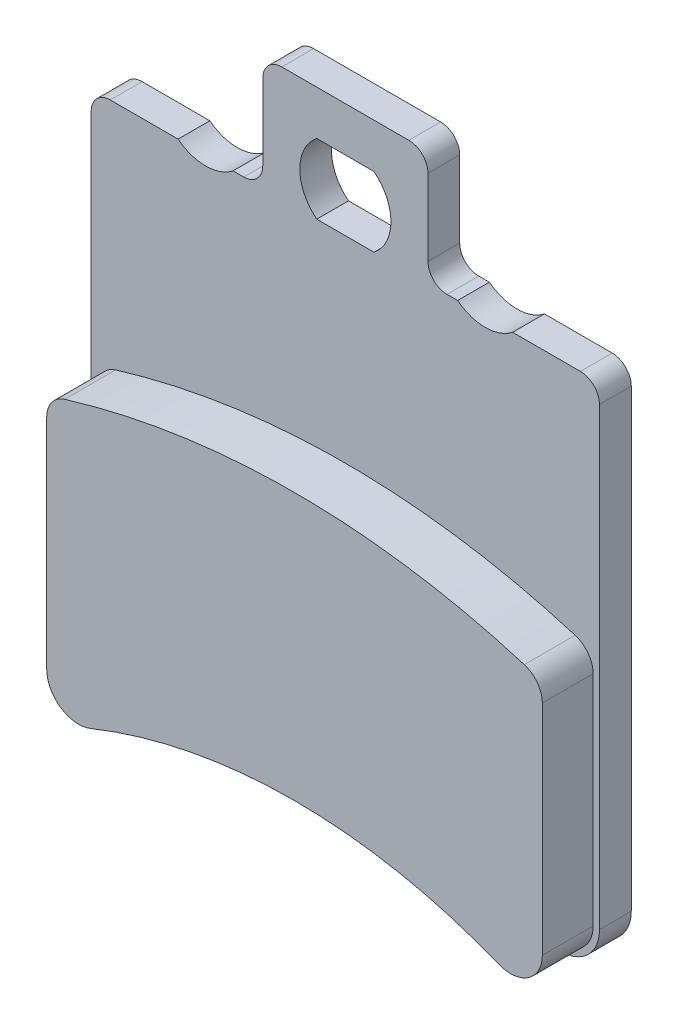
ISO-10303-21;
HEADER;
FILE_DESCRIPTION(('STEP AP214'),'2;1');
FILE_NAME('part.step','',(''),(''),'','','');
FILE_SCHEMA(('AUTOMOTIVE_DESIGN { 1 0 10303 214 1 1 1 1 }'));
ENDSEC;
DATA;
#1=APPLICATION_CONTEXT('core data for automotive mechanical design processes');
#2=APPLICATION_PROTOCOL_DEFINITION('international standard','automotive_design',2000,#1);
#3=PRODUCT_CONTEXT('',#1,'mechanical');
#4=PRODUCT('Part','Part','',(#3));
#5=PRODUCT_RELATED_PRODUCT_CATEGORY('part','',(#4));
#6=PRODUCT_DEFINITION_FORMATION('','',#4);
#7=PRODUCT_DEFINITION_CONTEXT('part definition',#1,'design');
#8=PRODUCT_DEFINITION('design','',#6,#7);
#9=PRODUCT_DEFINITION_SHAPE('','',#8);
#10=(LENGTH_UNIT() NAMED_UNIT(*) SI_UNIT(.MILLI.,.METRE.));
#11=(NAMED_UNIT(*) PLANE_ANGLE_UNIT() SI_UNIT($,.RADIAN.));
#12=(NAMED_UNIT(*) SI_UNIT($,.STERADIAN.) SOLID_ANGLE_UNIT());
#13=UNCERTAINTY_MEASURE_WITH_UNIT(LENGTH_MEASURE(1.E-05),#10,'distance_accuracy_value','');
#14=(GEOMETRIC_REPRESENTATION_CONTEXT(3) GLOBAL_UNCERTAINTY_ASSIGNED_CONTEXT((#13)) GLOBAL_UNIT_ASSIGNED_CONTEXT((#10,
#11,#12)) REPRESENTATION_CONTEXT('',''));
#15=CARTESIAN_POINT('',(0.,0.,0.));
#16=DIRECTION('',(0.,0.,1.));
#17=DIRECTION('',(1.,0.,0.));
#18=AXIS2_PLACEMENT_3D('',#15,#16,#17);
#19=CARTESIAN_POINT('',(-17.,-17.2951424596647,2.5));
#20=DIRECTION('',(0.,0.,1.));
#21=DIRECTION('',(1.,0.,0.));
#22=AXIS2_PLACEMENT_3D('',#19,#20,#21);
#23=PLANE('',#22);
#24=CARTESIAN_POINT('',(-17.5,-0.104115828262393,2.5));
#25=DIRECTION('',(0.,0.,1.));
#26=DIRECTION('',(-1.,0.,0.));
#27=AXIS2_PLACEMENT_3D('',#24,#25,#26);
#28=CIRCLE('',#27,2.);
#29=CARTESIAN_POINT('',(-18.0823316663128,1.80922936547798,2.5));
#30=VERTEX_POINT('',#29);
#31=CARTESIAN_POINT('',(-19.5,-0.104115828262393,2.5));
#32=VERTEX_POINT('',#31);
#33=EDGE_CURVE('E41',#30,#32,#28,.T.);
#34=ORIENTED_EDGE('',*,*,#33,.F.);
#35=CARTESIAN_POINT('',(0.,-57.6032058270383,2.5));
#36=DIRECTION('',(0.,0.,1.));
#37=DIRECTION('',(-1.,0.,0.));
#38=AXIS2_PLACEMENT_3D('',#35,#36,#37);
#39=CIRCLE('',#38,62.1032058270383);
#40=CARTESIAN_POINT('',(18.0823316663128,1.80922936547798,2.5));
#41=VERTEX_POINT('',#40);
#42=EDGE_CURVE('E45',#41,#30,#39,.T.);
#43=ORIENTED_EDGE('',*,*,#42,.F.);
#44=CARTESIAN_POINT('',(17.5,-0.104115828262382,2.5));
#45=DIRECTION('',(0.,0.,1.));
#46=DIRECTION('',(1.,0.,0.));
#47=AXIS2_PLACEMENT_3D('',#44,#45,#46);
#48=CIRCLE('',#47,2.);
#49=CARTESIAN_POINT('',(19.5,-0.104115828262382,2.5));
#50=VERTEX_POINT('',#49);
#51=EDGE_CURVE('E741',#50,#41,#48,.T.);
#52=ORIENTED_EDGE('',*,*,#51,.F.);
#53=DIRECTION('',(0.,1.,0.));
#54=VECTOR('',#53,1.);
#55=CARTESIAN_POINT('',(19.5,-17.2951424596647,2.5));
#56=LINE('',#55,#54);
#57=CARTESIAN_POINT('',(19.5,-17.2951424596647,2.5));
#58=VERTEX_POINT('',#57);
#59=EDGE_CURVE('E738',#58,#50,#56,.T.);
#60=ORIENTED_EDGE('',*,*,#59,.F.);
#61=CARTESIAN_POINT('',(17.,-17.2951424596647,2.5));
#62=DIRECTION('',(0.,0.,1.));
#63=DIRECTION('',(1.,0.,0.));
#64=AXIS2_PLACEMENT_3D('',#61,#62,#63);
#65=CIRCLE('',#64,2.5);
#66=CARTESIAN_POINT('',(16.0659340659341,-19.6140906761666,2.5));
#67=VERTEX_POINT('',#66);
#68=EDGE_CURVE('E735',#67,#58,#65,.T.);
#69=ORIENTED_EDGE('',*,*,#68,.F.);
#70=CARTESIAN_POINT('',(0.,-59.5,2.5));
#71=DIRECTION('',(0.,0.,-1.));
#72=DIRECTION('',(1.,0.,0.));
#73=AXIS2_PLACEMENT_3D('',#70,#71,#72);
#74=CIRCLE('',#73,43.);
#75=CARTESIAN_POINT('',(-16.0659340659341,-19.6140906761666,2.5));
#76=VERTEX_POINT('',#75);
#77=EDGE_CURVE('E237',#76,#67,#74,.T.);
#78=ORIENTED_EDGE('',*,*,#77,.F.);
#79=CARTESIAN_POINT('',(-17.,-17.2951424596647,2.5));
#80=DIRECTION('',(0.,0.,1.));
#81=DIRECTION('',(1.,0.,0.));
#82=AXIS2_PLACEMENT_3D('',#79,#80,#81);
#83=CIRCLE('',#82,2.5);
#84=CARTESIAN_POINT('',(-19.5,-17.2951424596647,2.5));
#85=VERTEX_POINT('',#84);
#86=EDGE_CURVE('E231',#85,#76,#83,.T.);
#87=ORIENTED_EDGE('',*,*,#86,.F.);
#88=DIRECTION('',(0.,-1.,0.));
#89=VECTOR('',#88,1.);
#90=CARTESIAN_POINT('',(-19.5,-0.104115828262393,2.5));
#91=LINE('',#90,#89);
#92=EDGE_CURVE('E234',#32,#85,#91,.T.);
#93=ORIENTED_EDGE('',*,*,#92,.F.);
#94=EDGE_LOOP('',(#34,#43,#52,#60,#69,#78,#87,#93));
#95=FACE_BOUND('',#94,.T.);
#96=CARTESIAN_POINT('',(-17.,-17.2951424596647,2.5));
#97=DIRECTION('',(0.,0.,1.));
#98=DIRECTION('',(1.,0.,0.));
#99=AXIS2_PLACEMENT_3D('',#96,#97,#98);
#100=CIRCLE('',#99,3.);
#101=CARTESIAN_POINT('',(-20.,-17.2951424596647,2.5));
#102=VERTEX_POINT('',#101);
#103=CARTESIAN_POINT('',(-15.8791208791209,-20.077880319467,2.5));
#104=VERTEX_POINT('',#103);
#105=EDGE_CURVE('E332',#102,#104,#100,.T.);
#106=ORIENTED_EDGE('',*,*,#105,.T.);
#107=CARTESIAN_POINT('',(0.,-59.5,2.5));
#108=DIRECTION('',(0.,0.,-1.));
#109=DIRECTION('',(-1.,0.,0.));
#110=AXIS2_PLACEMENT_3D('',#107,#108,#109);
#111=CIRCLE('',#110,42.5);
#112=CARTESIAN_POINT('',(15.8791208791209,-20.077880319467,2.5));
#113=VERTEX_POINT('',#112);
#114=EDGE_CURVE('E335',#104,#113,#111,.T.);
#115=ORIENTED_EDGE('',*,*,#114,.T.);
#116=CARTESIAN_POINT('',(17.,-17.2951424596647,2.5));
#117=DIRECTION('',(0.,0.,1.));
#118=DIRECTION('',(-1.,0.,0.));
#119=AXIS2_PLACEMENT_3D('',#116,#117,#118);
#120=CIRCLE('',#119,3.);
#121=CARTESIAN_POINT('',(20.,-17.2951424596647,2.5));
#122=VERTEX_POINT('',#121);
#123=EDGE_CURVE('E337',#113,#122,#120,.T.);
#124=ORIENTED_EDGE('',*,*,#123,.T.);
#125=DIRECTION('',(0.,1.,0.));
#126=VECTOR('',#125,1.);
#127=CARTESIAN_POINT('',(20.,-17.2951424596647,2.5));
#128=LINE('',#127,#126);
#129=CARTESIAN_POINT('',(20.,18.5,2.5));
#130=VERTEX_POINT('',#129);
#131=EDGE_CURVE('E339',#122,#130,#128,.T.);
#132=ORIENTED_EDGE('',*,*,#131,.T.);
#133=CARTESIAN_POINT('',(18.5,18.5,2.5));
#134=DIRECTION('',(0.,0.,1.));
#135=DIRECTION('',(1.,0.,0.));
#136=AXIS2_PLACEMENT_3D('',#133,#134,#135);
#137=CIRCLE('',#136,1.5);
#138=CARTESIAN_POINT('',(18.5,20.,2.5));
#139=VERTEX_POINT('',#138);
#140=EDGE_CURVE('E341',#130,#139,#137,.T.);
#141=ORIENTED_EDGE('',*,*,#140,.T.);
#142=DIRECTION('',(-1.,0.,0.));
#143=VECTOR('',#142,1.);
#144=CARTESIAN_POINT('',(13.1650635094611,20.,2.5));
#145=LINE('',#144,#143);
#146=CARTESIAN_POINT('',(13.1650635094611,20.,2.5));
#147=VERTEX_POINT('',#146);
#148=EDGE_CURVE('E343',#139,#147,#145,.T.);
#149=ORIENTED_EDGE('',*,*,#148,.T.);
#150=CARTESIAN_POINT('',(11.,22.75,2.5));
#151=DIRECTION('',(0.,0.,-1.));
#152=DIRECTION('',(1.,0.,0.));
#153=AXIS2_PLACEMENT_3D('',#150,#151,#152);
#154=CIRCLE('',#153,3.5);
#155=CARTESIAN_POINT('',(8.8349364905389,20.,2.5));
#156=VERTEX_POINT('',#155);
#157=EDGE_CURVE('E345',#147,#156,#154,.T.);
#158=ORIENTED_EDGE('',*,*,#157,.T.);
#159=DIRECTION('',(-1.,0.,0.));
#160=VECTOR('',#159,1.);
#161=CARTESIAN_POINT('',(8.,20.,2.5));
#162=LINE('',#161,#160);
#163=CARTESIAN_POINT('',(8.,20.,2.5));
#164=VERTEX_POINT('',#163);
#165=EDGE_CURVE('E347',#156,#164,#162,.T.);
#166=ORIENTED_EDGE('',*,*,#165,.T.);
#167=CARTESIAN_POINT('',(8.,21.5,2.5));
#168=DIRECTION('',(0.,0.,-1.));
#169=DIRECTION('',(1.,0.,0.));
#170=AXIS2_PLACEMENT_3D('',#167,#168,#169);
#171=CIRCLE('',#170,1.5);
#172=CARTESIAN_POINT('',(6.5,21.5,2.5));
#173=VERTEX_POINT('',#172);
#174=EDGE_CURVE('E349',#164,#173,#171,.T.);
#175=ORIENTED_EDGE('',*,*,#174,.T.);
#176=DIRECTION('',(0.,1.,0.));
#177=VECTOR('',#176,1.);
#178=CARTESIAN_POINT('',(6.5,21.5,2.5));
#179=LINE('',#178,#177);
#180=CARTESIAN_POINT('',(6.5,27.5,2.5));
#181=VERTEX_POINT('',#180);
#182=EDGE_CURVE('E351',#173,#181,#179,.T.);
#183=ORIENTED_EDGE('',*,*,#182,.T.);
#184=CARTESIAN_POINT('',(5.,27.5,2.5));
#185=DIRECTION('',(0.,0.,1.));
#186=DIRECTION('',(1.,0.,0.));
#187=AXIS2_PLACEMENT_3D('',#184,#185,#186);
#188=CIRCLE('',#187,1.5);
#189=CARTESIAN_POINT('',(5.,29.,2.5));
#190=VERTEX_POINT('',#189);
#191=EDGE_CURVE('E353',#181,#190,#188,.T.);
#192=ORIENTED_EDGE('',*,*,#191,.T.);
#193=DIRECTION('',(-1.,0.,0.));
#194=VECTOR('',#193,1.);
#195=CARTESIAN_POINT('',(-5.,29.,2.5));
#196=LINE('',#195,#194);
#197=CARTESIAN_POINT('',(-5.,29.,2.5));
#198=VERTEX_POINT('',#197);
#199=EDGE_CURVE('E355',#190,#198,#196,.T.);
#200=ORIENTED_EDGE('',*,*,#199,.T.);
#201=CARTESIAN_POINT('',(-5.,27.5,2.5));
#202=DIRECTION('',(0.,0.,1.));
#203=DIRECTION('',(1.,0.,0.));
#204=AXIS2_PLACEMENT_3D('',#201,#202,#203);
#205=CIRCLE('',#204,1.5);
#206=CARTESIAN_POINT('',(-6.5,27.5,2.5));
#207=VERTEX_POINT('',#206);
#208=EDGE_CURVE('E357',#198,#207,#205,.T.);
#209=ORIENTED_EDGE('',*,*,#208,.T.);
#210=DIRECTION('',(0.,-1.,0.));
#211=VECTOR('',#210,1.);
#212=CARTESIAN_POINT('',(-6.5,21.5,2.5));
#213=LINE('',#212,#211);
#214=CARTESIAN_POINT('',(-6.5,21.5,2.5));
#215=VERTEX_POINT('',#214);
#216=EDGE_CURVE('E359',#207,#215,#213,.T.);
#217=ORIENTED_EDGE('',*,*,#216,.T.);
#218=CARTESIAN_POINT('',(-8.,21.5,2.5));
#219=DIRECTION('',(0.,0.,-1.));
#220=DIRECTION('',(-1.,0.,0.));
#221=AXIS2_PLACEMENT_3D('',#218,#219,#220);
#222=CIRCLE('',#221,1.5);
#223=CARTESIAN_POINT('',(-8.,20.,2.5));
#224=VERTEX_POINT('',#223);
#225=EDGE_CURVE('E361',#215,#224,#222,.T.);
#226=ORIENTED_EDGE('',*,*,#225,.T.);
#227=DIRECTION('',(-1.,0.,0.));
#228=VECTOR('',#227,1.);
#229=CARTESIAN_POINT('',(-8.8349364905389,20.,2.5));
#230=LINE('',#229,#228);
#231=CARTESIAN_POINT('',(-8.8349364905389,20.,2.5));
#232=VERTEX_POINT('',#231);
#233=EDGE_CURVE('E363',#224,#232,#230,.T.);
#234=ORIENTED_EDGE('',*,*,#233,.T.);
#235=CARTESIAN_POINT('',(-11.,22.75,2.5));
#236=DIRECTION('',(0.,0.,-1.));
#237=DIRECTION('',(-1.,0.,0.));
#238=AXIS2_PLACEMENT_3D('',#235,#236,#237);
#239=CIRCLE('',#238,3.5);
#240=CARTESIAN_POINT('',(-13.1650635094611,20.,2.5));
#241=VERTEX_POINT('',#240);
#242=EDGE_CURVE('E365',#232,#241,#239,.T.);
#243=ORIENTED_EDGE('',*,*,#242,.T.);
#244=DIRECTION('',(-1.,0.,0.));
#245=VECTOR('',#244,1.);
#246=CARTESIAN_POINT('',(-18.5,20.,2.5));
#247=LINE('',#246,#245);
#248=CARTESIAN_POINT('',(-18.5,20.,2.5));
#249=VERTEX_POINT('',#248);
#250=EDGE_CURVE('E367',#241,#249,#247,.T.);
#251=ORIENTED_EDGE('',*,*,#250,.T.);
#252=CARTESIAN_POINT('',(-18.5,18.5,2.5));
#253=DIRECTION('',(0.,0.,1.));
#254=DIRECTION('',(1.,0.,0.));
#255=AXIS2_PLACEMENT_3D('',#252,#253,#254);
#256=CIRCLE('',#255,1.5);
#257=CARTESIAN_POINT('',(-20.,18.5,2.5));
#258=VERTEX_POINT('',#257);
#259=EDGE_CURVE('E369',#249,#258,#256,.T.);
#260=ORIENTED_EDGE('',*,*,#259,.T.);
#261=DIRECTION('',(0.,-1.,0.));
#262=VECTOR('',#261,1.);
#263=CARTESIAN_POINT('',(-20.,-17.2951424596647,2.5));
#264=LINE('',#263,#262);
#265=EDGE_CURVE('E371',#258,#102,#264,.T.);
#266=ORIENTED_EDGE('',*,*,#265,.T.);
#267=EDGE_LOOP('',(#106,#115,#124,#132,#141,#149,#158,#166,#175,#183,#192,#200,#209,#217,#226,
#234,#243,#251,#260,#266));
#268=FACE_BOUND('',#267,.T.);
#269=DIRECTION('',(1.,0.,0.));
#270=VECTOR('',#269,1.);
#271=CARTESIAN_POINT('',(-2.25,20.,2.5));
#272=LINE('',#271,#270);
#273=CARTESIAN_POINT('',(-2.25,20.,2.5));
#274=VERTEX_POINT('',#273);
#275=CARTESIAN_POINT('',(2.25,20.,2.5));
#276=VERTEX_POINT('',#275);
#277=EDGE_CURVE('E274',#274,#276,#272,.T.);
#278=ORIENTED_EDGE('',*,*,#277,.F.);
#279=CARTESIAN_POINT('',(-0.0849364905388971,22.75,2.5));
#280=DIRECTION('',(0.,0.,1.));
#281=DIRECTION('',(1.,0.,0.));
#282=AXIS2_PLACEMENT_3D('',#279,#280,#281);
#283=CIRCLE('',#282,3.5);
#284=CARTESIAN_POINT('',(-2.25,25.5,2.5));
#285=VERTEX_POINT('',#284);
#286=EDGE_CURVE('E272',#285,#274,#283,.T.);
#287=ORIENTED_EDGE('',*,*,#286,.F.);
#288=DIRECTION('',(-1.,0.,0.));
#289=VECTOR('',#288,1.);
#290=CARTESIAN_POINT('',(-2.25,25.5,2.5));
#291=LINE('',#290,#289);
#292=CARTESIAN_POINT('',(2.25,25.5,2.5));
#293=VERTEX_POINT('',#292);
#294=EDGE_CURVE('E279',#293,#285,#291,.T.);
#295=ORIENTED_EDGE('',*,*,#294,.F.);
#296=CARTESIAN_POINT('',(0.0849364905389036,22.75,2.5));
#297=DIRECTION('',(0.,0.,1.));
#298=DIRECTION('',(-1.,0.,0.));
#299=AXIS2_PLACEMENT_3D('',#296,#297,#298);
#300=CIRCLE('',#299,3.5);
#301=EDGE_CURVE('E276',#276,#293,#300,.T.);
#302=ORIENTED_EDGE('',*,*,#301,.F.);
#303=EDGE_LOOP('',(#278,#287,#295,#302));
#304=FACE_BOUND('',#303,.T.);
#305=ADVANCED_FACE('F26',(#95,#268,#304),#23,.T.);
#306=CARTESIAN_POINT('',(-17.,-17.2951424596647,0.));
#307=DIRECTION('',(0.,0.,1.));
#308=DIRECTION('',(1.,0.,0.));
#309=AXIS2_PLACEMENT_3D('',#306,#307,#308);
#310=PLANE('',#309);
#311=CARTESIAN_POINT('',(-17.,-17.2951424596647,0.));
#312=DIRECTION('',(0.,0.,1.));
#313=DIRECTION('',(1.,0.,0.));
#314=AXIS2_PLACEMENT_3D('',#311,#312,#313);
#315=CIRCLE('',#314,3.);
#316=CARTESIAN_POINT('',(-20.,-17.2951424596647,0.));
#317=VERTEX_POINT('',#316);
#318=CARTESIAN_POINT('',(-15.8791208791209,-20.077880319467,0.));
#319=VERTEX_POINT('',#318);
#320=EDGE_CURVE('E291',#317,#319,#315,.T.);
#321=ORIENTED_EDGE('',*,*,#320,.F.);
#322=DIRECTION('',(0.,-1.,0.));
#323=VECTOR('',#322,1.);
#324=CARTESIAN_POINT('',(-20.,-17.2951424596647,0.));
#325=LINE('',#324,#323);
#326=CARTESIAN_POINT('',(-20.,18.5,0.));
#327=VERTEX_POINT('',#326);
#328=EDGE_CURVE('E330',#327,#317,#325,.T.);
#329=ORIENTED_EDGE('',*,*,#328,.F.);
#330=CARTESIAN_POINT('',(-18.5,18.5,0.));
#331=DIRECTION('',(0.,0.,1.));
#332=DIRECTION('',(1.,0.,0.));
#333=AXIS2_PLACEMENT_3D('',#330,#331,#332);
#334=CIRCLE('',#333,1.5);
#335=CARTESIAN_POINT('',(-18.5,20.,0.));
#336=VERTEX_POINT('',#335);
#337=EDGE_CURVE('E328',#336,#327,#334,.T.);
#338=ORIENTED_EDGE('',*,*,#337,.F.);
#339=DIRECTION('',(-1.,0.,0.));
#340=VECTOR('',#339,1.);
#341=CARTESIAN_POINT('',(-18.5,20.,0.));
#342=LINE('',#341,#340);
#343=CARTESIAN_POINT('',(-13.1650635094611,20.,0.));
#344=VERTEX_POINT('',#343);
#345=EDGE_CURVE('E326',#344,#336,#342,.T.);
#346=ORIENTED_EDGE('',*,*,#345,.F.);
#347=CARTESIAN_POINT('',(-11.,22.75,0.));
#348=DIRECTION('',(0.,0.,-1.));
#349=DIRECTION('',(-1.,0.,0.));
#350=AXIS2_PLACEMENT_3D('',#347,#348,#349);
#351=CIRCLE('',#350,3.5);
#352=CARTESIAN_POINT('',(-8.8349364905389,20.,0.));
#353=VERTEX_POINT('',#352);
#354=EDGE_CURVE('E324',#353,#344,#351,.T.);
#355=ORIENTED_EDGE('',*,*,#354,.F.);
#356=DIRECTION('',(-1.,0.,0.));
#357=VECTOR('',#356,1.);
#358=CARTESIAN_POINT('',(-8.8349364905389,20.,0.));
#359=LINE('',#358,#357);
#360=CARTESIAN_POINT('',(-8.,20.,0.));
#361=VERTEX_POINT('',#360);
#362=EDGE_CURVE('E322',#361,#353,#359,.T.);
#363=ORIENTED_EDGE('',*,*,#362,.F.);
#364=CARTESIAN_POINT('',(-8.,21.5,0.));
#365=DIRECTION('',(0.,0.,-1.));
#366=DIRECTION('',(-1.,0.,0.));
#367=AXIS2_PLACEMENT_3D('',#364,#365,#366);
#368=CIRCLE('',#367,1.5);
#369=CARTESIAN_POINT('',(-6.5,21.5,0.));
#370=VERTEX_POINT('',#369);
#371=EDGE_CURVE('E320',#370,#361,#368,.T.);
#372=ORIENTED_EDGE('',*,*,#371,.F.);
#373=DIRECTION('',(0.,-1.,0.));
#374=VECTOR('',#373,1.);
#375=CARTESIAN_POINT('',(-6.5,21.5,0.));
#376=LINE('',#375,#374);
#377=CARTESIAN_POINT('',(-6.5,27.5,0.));
#378=VERTEX_POINT('',#377);
#379=EDGE_CURVE('E318',#378,#370,#376,.T.);
#380=ORIENTED_EDGE('',*,*,#379,.F.);
#381=CARTESIAN_POINT('',(-5.,27.5,0.));
#382=DIRECTION('',(0.,0.,1.));
#383=DIRECTION('',(1.,0.,0.));
#384=AXIS2_PLACEMENT_3D('',#381,#382,#383);
#385=CIRCLE('',#384,1.5);
#386=CARTESIAN_POINT('',(-5.,29.,0.));
#387=VERTEX_POINT('',#386);
#388=EDGE_CURVE('E316',#387,#378,#385,.T.);
#389=ORIENTED_EDGE('',*,*,#388,.F.);
#390=DIRECTION('',(-1.,0.,0.));
#391=VECTOR('',#390,1.);
#392=CARTESIAN_POINT('',(-5.,29.,0.));
#393=LINE('',#392,#391);
#394=CARTESIAN_POINT('',(5.,29.,0.));
#395=VERTEX_POINT('',#394);
#396=EDGE_CURVE('E314',#395,#387,#393,.T.);
#397=ORIENTED_EDGE('',*,*,#396,.F.);
#398=CARTESIAN_POINT('',(5.,27.5,0.));
#399=DIRECTION('',(0.,0.,1.));
#400=DIRECTION('',(1.,0.,0.));
#401=AXIS2_PLACEMENT_3D('',#398,#399,#400);
#402=CIRCLE('',#401,1.5);
#403=CARTESIAN_POINT('',(6.5,27.5,0.));
#404=VERTEX_POINT('',#403);
#405=EDGE_CURVE('E312',#404,#395,#402,.T.);
#406=ORIENTED_EDGE('',*,*,#405,.F.);
#407=DIRECTION('',(0.,1.,0.));
#408=VECTOR('',#407,1.);
#409=CARTESIAN_POINT('',(6.5,21.5,0.));
#410=LINE('',#409,#408);
#411=CARTESIAN_POINT('',(6.5,21.5,0.));
#412=VERTEX_POINT('',#411);
#413=EDGE_CURVE('E310',#412,#404,#410,.T.);
#414=ORIENTED_EDGE('',*,*,#413,.F.);
#415=CARTESIAN_POINT('',(8.,21.5,0.));
#416=DIRECTION('',(0.,0.,-1.));
#417=DIRECTION('',(1.,0.,0.));
#418=AXIS2_PLACEMENT_3D('',#415,#416,#417);
#419=CIRCLE('',#418,1.5);
#420=CARTESIAN_POINT('',(8.,20.,0.));
#421=VERTEX_POINT('',#420);
#422=EDGE_CURVE('E308',#421,#412,#419,.T.);
#423=ORIENTED_EDGE('',*,*,#422,.F.);
#424=DIRECTION('',(-1.,0.,0.));
#425=VECTOR('',#424,1.);
#426=CARTESIAN_POINT('',(8.,20.,0.));
#427=LINE('',#426,#425);
#428=CARTESIAN_POINT('',(8.8349364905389,20.,0.));
#429=VERTEX_POINT('',#428);
#430=EDGE_CURVE('E306',#429,#421,#427,.T.);
#431=ORIENTED_EDGE('',*,*,#430,.F.);
#432=CARTESIAN_POINT('',(11.,22.75,0.));
#433=DIRECTION('',(0.,0.,-1.));
#434=DIRECTION('',(1.,0.,0.));
#435=AXIS2_PLACEMENT_3D('',#432,#433,#434);
#436=CIRCLE('',#435,3.5);
#437=CARTESIAN_POINT('',(13.1650635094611,20.,0.));
#438=VERTEX_POINT('',#437);
#439=EDGE_CURVE('E304',#438,#429,#436,.T.);
#440=ORIENTED_EDGE('',*,*,#439,.F.);
#441=DIRECTION('',(-1.,0.,0.));
#442=VECTOR('',#441,1.);
#443=CARTESIAN_POINT('',(13.1650635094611,20.,0.));
#444=LINE('',#443,#442);
#445=CARTESIAN_POINT('',(18.5,20.,0.));
#446=VERTEX_POINT('',#445);
#447=EDGE_CURVE('E302',#446,#438,#444,.T.);
#448=ORIENTED_EDGE('',*,*,#447,.F.);
#449=CARTESIAN_POINT('',(18.5,18.5,0.));
#450=DIRECTION('',(0.,0.,1.));
#451=DIRECTION('',(1.,0.,0.));
#452=AXIS2_PLACEMENT_3D('',#449,#450,#451);
#453=CIRCLE('',#452,1.5);
#454=CARTESIAN_POINT('',(20.,18.5,0.));
#455=VERTEX_POINT('',#454);
#456=EDGE_CURVE('E300',#455,#446,#453,.T.);
#457=ORIENTED_EDGE('',*,*,#456,.F.);
#458=DIRECTION('',(0.,1.,0.));
#459=VECTOR('',#458,1.);
#460=CARTESIAN_POINT('',(20.,-17.2951424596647,0.));
#461=LINE('',#460,#459);
#462=CARTESIAN_POINT('',(20.,-17.2951424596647,0.));
#463=VERTEX_POINT('',#462);
#464=EDGE_CURVE('E298',#463,#455,#461,.T.);
#465=ORIENTED_EDGE('',*,*,#464,.F.);
#466=CARTESIAN_POINT('',(17.,-17.2951424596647,0.));
#467=DIRECTION('',(0.,0.,1.));
#468=DIRECTION('',(-1.,0.,0.));
#469=AXIS2_PLACEMENT_3D('',#466,#467,#468);
#470=CIRCLE('',#469,3.);
#471=CARTESIAN_POINT('',(15.8791208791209,-20.077880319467,0.));
#472=VERTEX_POINT('',#471);
#473=EDGE_CURVE('E296',#472,#463,#470,.T.);
#474=ORIENTED_EDGE('',*,*,#473,.F.);
#475=CARTESIAN_POINT('',(0.,-59.5,0.));
#476=DIRECTION('',(0.,0.,-1.));
#477=DIRECTION('',(-1.,0.,0.));
#478=AXIS2_PLACEMENT_3D('',#475,#476,#477);
#479=CIRCLE('',#478,42.5);
#480=EDGE_CURVE('E294',#319,#472,#479,.T.);
#481=ORIENTED_EDGE('',*,*,#480,.F.);
#482=EDGE_LOOP('',(#321,#329,#338,#346,#355,#363,#372,#380,#389,#397,#406,#414,#423,#431,#440,
#448,#457,#465,#474,#481));
#483=FACE_BOUND('',#482,.T.);
#484=CARTESIAN_POINT('',(-0.0849364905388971,22.75,0.));
#485=DIRECTION('',(0.,0.,1.));
#486=DIRECTION('',(1.,0.,0.));
#487=AXIS2_PLACEMENT_3D('',#484,#485,#486);
#488=CIRCLE('',#487,3.5);
#489=CARTESIAN_POINT('',(-2.25,25.5,0.));
#490=VERTEX_POINT('',#489);
#491=CARTESIAN_POINT('',(-2.25,20.,0.));
#492=VERTEX_POINT('',#491);
#493=EDGE_CURVE('E255',#490,#492,#488,.T.);
#494=ORIENTED_EDGE('',*,*,#493,.T.);
#495=DIRECTION('',(1.,0.,0.));
#496=VECTOR('',#495,1.);
#497=CARTESIAN_POINT('',(-2.25,20.,0.));
#498=LINE('',#497,#496);
#499=CARTESIAN_POINT('',(2.25,20.,0.));
#500=VERTEX_POINT('',#499);
#501=EDGE_CURVE('E263',#492,#500,#498,.T.);
#502=ORIENTED_EDGE('',*,*,#501,.T.);
#503=CARTESIAN_POINT('',(0.0849364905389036,22.75,0.));
#504=DIRECTION('',(0.,0.,1.));
#505=DIRECTION('',(-1.,0.,0.));
#506=AXIS2_PLACEMENT_3D('',#503,#504,#505);
#507=CIRCLE('',#506,3.5);
#508=CARTESIAN_POINT('',(2.25,25.5,0.));
#509=VERTEX_POINT('',#508);
#510=EDGE_CURVE('E266',#500,#509,#507,.T.);
#511=ORIENTED_EDGE('',*,*,#510,.T.);
#512=DIRECTION('',(-1.,0.,0.));
#513=VECTOR('',#512,1.);
#514=CARTESIAN_POINT('',(-2.25,25.5,0.));
#515=LINE('',#514,#513);
#516=EDGE_CURVE('E269',#509,#490,#515,.T.);
#517=ORIENTED_EDGE('',*,*,#516,.T.);
#518=EDGE_LOOP('',(#494,#502,#511,#517));
#519=FACE_BOUND('',#518,.T.);
#520=ADVANCED_FACE('F437',(#483,#519),#310,.F.);
#521=CARTESIAN_POINT('',(-17.,-17.2951424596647,2.5));
#522=DIRECTION('',(0.,0.,-1.));
#523=DIRECTION('',(-1.,0.,0.));
#524=AXIS2_PLACEMENT_3D('',#521,#522,#523);
#525=CYLINDRICAL_SURFACE('',#524,3.);
#526=ORIENTED_EDGE('',*,*,#320,.T.);
#527=DIRECTION('',(0.,0.,-1.));
#528=VECTOR('',#527,1.);
#529=CARTESIAN_POINT('',(-15.8791208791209,-20.077880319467,2.5));
#530=LINE('',#529,#528);
#531=EDGE_CURVE('E11',#104,#319,#530,.T.);
#532=ORIENTED_EDGE('',*,*,#531,.F.);
#533=ORIENTED_EDGE('',*,*,#105,.F.);
#534=DIRECTION('',(0.,0.,-1.));
#535=VECTOR('',#534,1.);
#536=CARTESIAN_POINT('',(-20.,-17.2951424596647,2.5));
#537=LINE('',#536,#535);
#538=EDGE_CURVE('E373',#102,#317,#537,.T.);
#539=ORIENTED_EDGE('',*,*,#538,.T.);
#540=EDGE_LOOP('',(#526,#532,#533,#539));
#541=FACE_BOUND('',#540,.T.);
#542=ADVANCED_FACE('F28',(#541),#525,.T.);
#543=CARTESIAN_POINT('',(0.,-59.5,2.5));
#544=DIRECTION('',(0.,0.,-1.));
#545=DIRECTION('',(-1.,0.,0.));
#546=AXIS2_PLACEMENT_3D('',#543,#544,#545);
#547=CYLINDRICAL_SURFACE('',#546,42.5);
#548=ORIENTED_EDGE('',*,*,#480,.T.);
#549=DIRECTION('',(0.,0.,-1.));
#550=VECTOR('',#549,1.);
#551=CARTESIAN_POINT('',(15.8791208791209,-20.077880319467,2.5));
#552=LINE('',#551,#550);
#553=EDGE_CURVE('E34',#113,#472,#552,.T.);
#554=ORIENTED_EDGE('',*,*,#553,.F.);
#555=ORIENTED_EDGE('',*,*,#114,.F.);
#556=ORIENTED_EDGE('',*,*,#531,.T.);
#557=EDGE_LOOP('',(#548,#554,#555,#556));
#558=FACE_BOUND('',#557,.T.);
#559=ADVANCED_FACE('F454',(#558),#547,.F.);
#560=CARTESIAN_POINT('',(17.,-17.2951424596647,2.5));
#561=DIRECTION('',(0.,0.,-1.));
#562=DIRECTION('',(-1.,0.,0.));
#563=AXIS2_PLACEMENT_3D('',#560,#561,#562);
#564=CYLINDRICAL_SURFACE('',#563,3.);
#565=ORIENTED_EDGE('',*,*,#473,.T.);
#566=DIRECTION('',(0.,0.,-1.));
#567=VECTOR('',#566,1.);
#568=CARTESIAN_POINT('',(20.,-17.2951424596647,2.5));
#569=LINE('',#568,#567);
#570=EDGE_CURVE('E424',#122,#463,#569,.T.);
#571=ORIENTED_EDGE('',*,*,#570,.F.);
#572=ORIENTED_EDGE('',*,*,#123,.F.);
#573=ORIENTED_EDGE('',*,*,#553,.T.);
#574=EDGE_LOOP('',(#565,#571,#572,#573));
#575=FACE_BOUND('',#574,.T.);
#576=ADVANCED_FACE('F431',(#575),#564,.T.);
#577=CARTESIAN_POINT('',(20.,-17.2951424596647,2.5));
#578=DIRECTION('',(-1.,0.,0.));
#579=DIRECTION('',(0.,0.,1.));
#580=AXIS2_PLACEMENT_3D('',#577,#578,#579);
#581=PLANE('',#580);
#582=ORIENTED_EDGE('',*,*,#464,.T.);
#583=DIRECTION('',(0.,0.,-1.));
#584=VECTOR('',#583,1.);
#585=CARTESIAN_POINT('',(20.,18.5,2.5));
#586=LINE('',#585,#584);
#587=EDGE_CURVE('E421',#130,#455,#586,.T.);
#588=ORIENTED_EDGE('',*,*,#587,.F.);
#589=ORIENTED_EDGE('',*,*,#131,.F.);
#590=ORIENTED_EDGE('',*,*,#570,.T.);
#591=EDGE_LOOP('',(#582,#588,#589,#590));
#592=FACE_BOUND('',#591,.T.);
#593=ADVANCED_FACE('F443',(#592),#581,.F.);
#594=CARTESIAN_POINT('',(18.5,18.5,2.5));
#595=DIRECTION('',(0.,0.,-1.));
#596=DIRECTION('',(-1.,0.,0.));
#597=AXIS2_PLACEMENT_3D('',#594,#595,#596);
#598=CYLINDRICAL_SURFACE('',#597,1.5);
#599=ORIENTED_EDGE('',*,*,#456,.T.);
#600=DIRECTION('',(0.,0.,-1.));
#601=VECTOR('',#600,1.);
#602=CARTESIAN_POINT('',(18.5,20.,2.5));
#603=LINE('',#602,#601);
#604=EDGE_CURVE('E418',#139,#446,#603,.T.);
#605=ORIENTED_EDGE('',*,*,#604,.F.);
#606=ORIENTED_EDGE('',*,*,#140,.F.);
#607=ORIENTED_EDGE('',*,*,#587,.T.);
#608=EDGE_LOOP('',(#599,#605,#606,#607));
#609=FACE_BOUND('',#608,.T.);
#610=ADVANCED_FACE('F447',(#609),#598,.T.);
#611=CARTESIAN_POINT('',(13.1650635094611,20.,2.5));
#612=DIRECTION('',(0.,-1.,0.));
#613=DIRECTION('',(1.,0.,0.));
#614=AXIS2_PLACEMENT_3D('',#611,#612,#613);
#615=PLANE('',#614);
#616=ORIENTED_EDGE('',*,*,#447,.T.);
#617=DIRECTION('',(0.,0.,-1.));
#618=VECTOR('',#617,1.);
#619=CARTESIAN_POINT('',(13.1650635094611,20.,2.5));
#620=LINE('',#619,#618);
#621=EDGE_CURVE('E415',#147,#438,#620,.T.);
#622=ORIENTED_EDGE('',*,*,#621,.F.);
#623=ORIENTED_EDGE('',*,*,#148,.F.);
#624=ORIENTED_EDGE('',*,*,#604,.T.);
#625=EDGE_LOOP('',(#616,#622,#623,#624));
#626=FACE_BOUND('',#625,.T.);
#627=ADVANCED_FACE('F527',(#626),#615,.F.);
#628=CARTESIAN_POINT('',(11.,22.75,2.5));
#629=DIRECTION('',(0.,0.,-1.));
#630=DIRECTION('',(-1.,0.,0.));
#631=AXIS2_PLACEMENT_3D('',#628,#629,#630);
#632=CYLINDRICAL_SURFACE('',#631,3.5);
#633=ORIENTED_EDGE('',*,*,#439,.T.);
#634=DIRECTION('',(0.,0.,-1.));
#635=VECTOR('',#634,1.);
#636=CARTESIAN_POINT('',(8.8349364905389,20.,2.5));
#637=LINE('',#636,#635);
#638=EDGE_CURVE('E412',#156,#429,#637,.T.);
#639=ORIENTED_EDGE('',*,*,#638,.F.);
#640=ORIENTED_EDGE('',*,*,#157,.F.);
#641=ORIENTED_EDGE('',*,*,#621,.T.);
#642=EDGE_LOOP('',(#633,#639,#640,#641));
#643=FACE_BOUND('',#642,.T.);
#644=ADVANCED_FACE('F525',(#643),#632,.F.);
#645=CARTESIAN_POINT('',(8.,20.,2.5));
#646=DIRECTION('',(0.,-1.,0.));
#647=DIRECTION('',(1.,0.,0.));
#648=AXIS2_PLACEMENT_3D('',#645,#646,#647);
#649=PLANE('',#648);
#650=ORIENTED_EDGE('',*,*,#430,.T.);
#651=DIRECTION('',(0.,0.,-1.));
#652=VECTOR('',#651,1.);
#653=CARTESIAN_POINT('',(8.,20.,2.5));
#654=LINE('',#653,#652);
#655=EDGE_CURVE('E409',#164,#421,#654,.T.);
#656=ORIENTED_EDGE('',*,*,#655,.F.);
#657=ORIENTED_EDGE('',*,*,#165,.F.);
#658=ORIENTED_EDGE('',*,*,#638,.T.);
#659=EDGE_LOOP('',(#650,#656,#657,#658));
#660=FACE_BOUND('',#659,.T.);
#661=ADVANCED_FACE('F520',(#660),#649,.F.);
#662=CARTESIAN_POINT('',(8.,21.5,2.5));
#663=DIRECTION('',(0.,0.,-1.));
#664=DIRECTION('',(-1.,0.,0.));
#665=AXIS2_PLACEMENT_3D('',#662,#663,#664);
#666=CYLINDRICAL_SURFACE('',#665,1.5);
#667=ORIENTED_EDGE('',*,*,#422,.T.);
#668=DIRECTION('',(0.,0.,-1.));
#669=VECTOR('',#668,1.);
#670=CARTESIAN_POINT('',(6.5,21.5,2.5));
#671=LINE('',#670,#669);
#672=EDGE_CURVE('E406',#173,#412,#671,.T.);
#673=ORIENTED_EDGE('',*,*,#672,.F.);
#674=ORIENTED_EDGE('',*,*,#174,.F.);
#675=ORIENTED_EDGE('',*,*,#655,.T.);
#676=EDGE_LOOP('',(#667,#673,#674,#675));
#677=FACE_BOUND('',#676,.T.);
#678=ADVANCED_FACE('F515',(#677),#666,.F.);
#679=CARTESIAN_POINT('',(6.5,21.5,2.5));
#680=DIRECTION('',(-1.,0.,0.));
#681=DIRECTION('',(0.,-1.,0.));
#682=AXIS2_PLACEMENT_3D('',#679,#680,#681);
#683=PLANE('',#682);
#684=ORIENTED_EDGE('',*,*,#413,.T.);
#685=DIRECTION('',(0.,0.,-1.));
#686=VECTOR('',#685,1.);
#687=CARTESIAN_POINT('',(6.5,27.5,2.5));
#688=LINE('',#687,#686);
#689=EDGE_CURVE('E403',#181,#404,#688,.T.);
#690=ORIENTED_EDGE('',*,*,#689,.F.);
#691=ORIENTED_EDGE('',*,*,#182,.F.);
#692=ORIENTED_EDGE('',*,*,#672,.T.);
#693=EDGE_LOOP('',(#684,#690,#691,#692));
#694=FACE_BOUND('',#693,.T.);
#695=ADVANCED_FACE('F511',(#694),#683,.F.);
#696=CARTESIAN_POINT('',(5.,27.5,2.5));
#697=DIRECTION('',(0.,0.,-1.));
#698=DIRECTION('',(-1.,0.,0.));
#699=AXIS2_PLACEMENT_3D('',#696,#697,#698);
#700=CYLINDRICAL_SURFACE('',#699,1.5);
#701=ORIENTED_EDGE('',*,*,#405,.T.);
#702=DIRECTION('',(0.,0.,-1.));
#703=VECTOR('',#702,1.);
#704=CARTESIAN_POINT('',(5.,29.,2.5));
#705=LINE('',#704,#703);
#706=EDGE_CURVE('E400',#190,#395,#705,.T.);
#707=ORIENTED_EDGE('',*,*,#706,.F.);
#708=ORIENTED_EDGE('',*,*,#191,.F.);
#709=ORIENTED_EDGE('',*,*,#689,.T.);
#710=EDGE_LOOP('',(#701,#707,#708,#709));
#711=FACE_BOUND('',#710,.T.);
#712=ADVANCED_FACE('F506',(#711),#700,.T.);
#713=CARTESIAN_POINT('',(-5.,29.,2.5));
#714=DIRECTION('',(0.,-1.,0.));
#715=DIRECTION('',(1.,0.,0.));
#716=AXIS2_PLACEMENT_3D('',#713,#714,#715);
#717=PLANE('',#716);
#718=ORIENTED_EDGE('',*,*,#396,.T.);
#719=DIRECTION('',(0.,0.,-1.));
#720=VECTOR('',#719,1.);
#721=CARTESIAN_POINT('',(-5.,29.,2.5));
#722=LINE('',#721,#720);
#723=EDGE_CURVE('E397',#198,#387,#722,.T.);
#724=ORIENTED_EDGE('',*,*,#723,.F.);
#725=ORIENTED_EDGE('',*,*,#199,.F.);
#726=ORIENTED_EDGE('',*,*,#706,.T.);
#727=EDGE_LOOP('',(#718,#724,#725,#726));
#728=FACE_BOUND('',#727,.T.);
#729=ADVANCED_FACE('F500',(#728),#717,.F.);
#730=CARTESIAN_POINT('',(-5.,27.5,2.5));
#731=DIRECTION('',(0.,0.,-1.));
#732=DIRECTION('',(-1.,0.,0.));
#733=AXIS2_PLACEMENT_3D('',#730,#731,#732);
#734=CYLINDRICAL_SURFACE('',#733,1.5);
#735=ORIENTED_EDGE('',*,*,#388,.T.);
#736=DIRECTION('',(0.,0.,-1.));
#737=VECTOR('',#736,1.);
#738=CARTESIAN_POINT('',(-6.5,27.5,2.5));
#739=LINE('',#738,#737);
#740=EDGE_CURVE('E394',#207,#378,#739,.T.);
#741=ORIENTED_EDGE('',*,*,#740,.F.);
#742=ORIENTED_EDGE('',*,*,#208,.F.);
#743=ORIENTED_EDGE('',*,*,#723,.T.);
#744=EDGE_LOOP('',(#735,#741,#742,#743));
#745=FACE_BOUND('',#744,.T.);
#746=ADVANCED_FACE('F496',(#745),#734,.T.);
#747=CARTESIAN_POINT('',(-6.5,21.5,2.5));
#748=DIRECTION('',(1.,0.,0.));
#749=DIRECTION('',(0.,1.,0.));
#750=AXIS2_PLACEMENT_3D('',#747,#748,#749);
#751=PLANE('',#750);
#752=ORIENTED_EDGE('',*,*,#379,.T.);
#753=DIRECTION('',(0.,0.,-1.));
#754=VECTOR('',#753,1.);
#755=CARTESIAN_POINT('',(-6.5,21.5,2.5));
#756=LINE('',#755,#754);
#757=EDGE_CURVE('E391',#215,#370,#756,.T.);
#758=ORIENTED_EDGE('',*,*,#757,.F.);
#759=ORIENTED_EDGE('',*,*,#216,.F.);
#760=ORIENTED_EDGE('',*,*,#740,.T.);
#761=EDGE_LOOP('',(#752,#758,#759,#760));
#762=FACE_BOUND('',#761,.T.);
#763=ADVANCED_FACE('F491',(#762),#751,.F.);
#764=CARTESIAN_POINT('',(-8.,21.5,2.5));
#765=DIRECTION('',(0.,0.,-1.));
#766=DIRECTION('',(-1.,0.,0.));
#767=AXIS2_PLACEMENT_3D('',#764,#765,#766);
#768=CYLINDRICAL_SURFACE('',#767,1.5);
#769=ORIENTED_EDGE('',*,*,#371,.T.);
#770=DIRECTION('',(0.,0.,-1.));
#771=VECTOR('',#770,1.);
#772=CARTESIAN_POINT('',(-8.,20.,2.5));
#773=LINE('',#772,#771);
#774=EDGE_CURVE('E388',#224,#361,#773,.T.);
#775=ORIENTED_EDGE('',*,*,#774,.F.);
#776=ORIENTED_EDGE('',*,*,#225,.F.);
#777=ORIENTED_EDGE('',*,*,#757,.T.);
#778=EDGE_LOOP('',(#769,#775,#776,#777));
#779=FACE_BOUND('',#778,.T.);
#780=ADVANCED_FACE('F485',(#779),#768,.F.);
#781=CARTESIAN_POINT('',(-8.8349364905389,20.,2.5));
#782=DIRECTION('',(0.,-1.,0.));
#783=DIRECTION('',(1.,0.,0.));
#784=AXIS2_PLACEMENT_3D('',#781,#782,#783);
#785=PLANE('',#784);
#786=ORIENTED_EDGE('',*,*,#362,.T.);
#787=DIRECTION('',(0.,0.,-1.));
#788=VECTOR('',#787,1.);
#789=CARTESIAN_POINT('',(-8.8349364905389,20.,2.5));
#790=LINE('',#789,#788);
#791=EDGE_CURVE('E385',#232,#353,#790,.T.);
#792=ORIENTED_EDGE('',*,*,#791,.F.);
#793=ORIENTED_EDGE('',*,*,#233,.F.);
#794=ORIENTED_EDGE('',*,*,#774,.T.);
#795=EDGE_LOOP('',(#786,#792,#793,#794));
#796=FACE_BOUND('',#795,.T.);
#797=ADVANCED_FACE('F481',(#796),#785,.F.);
#798=CARTESIAN_POINT('',(-11.,22.75,2.5));
#799=DIRECTION('',(0.,0.,-1.));
#800=DIRECTION('',(-1.,0.,0.));
#801=AXIS2_PLACEMENT_3D('',#798,#799,#800);
#802=CYLINDRICAL_SURFACE('',#801,3.5);
#803=ORIENTED_EDGE('',*,*,#354,.T.);
#804=DIRECTION('',(0.,0.,-1.));
#805=VECTOR('',#804,1.);
#806=CARTESIAN_POINT('',(-13.1650635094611,20.,2.5));
#807=LINE('',#806,#805);
#808=EDGE_CURVE('E382',#241,#344,#807,.T.);
#809=ORIENTED_EDGE('',*,*,#808,.F.);
#810=ORIENTED_EDGE('',*,*,#242,.F.);
#811=ORIENTED_EDGE('',*,*,#791,.T.);
#812=EDGE_LOOP('',(#803,#809,#810,#811));
#813=FACE_BOUND('',#812,.T.);
#814=ADVANCED_FACE('F476',(#813),#802,.F.);
#815=CARTESIAN_POINT('',(-18.5,20.,2.5));
#816=DIRECTION('',(0.,-1.,0.));
#817=DIRECTION('',(1.,0.,0.));
#818=AXIS2_PLACEMENT_3D('',#815,#816,#817);
#819=PLANE('',#818);
#820=ORIENTED_EDGE('',*,*,#345,.T.);
#821=DIRECTION('',(0.,0.,-1.));
#822=VECTOR('',#821,1.);
#823=CARTESIAN_POINT('',(-18.5,20.,2.5));
#824=LINE('',#823,#822);
#825=EDGE_CURVE('E379',#249,#336,#824,.T.);
#826=ORIENTED_EDGE('',*,*,#825,.F.);
#827=ORIENTED_EDGE('',*,*,#250,.F.);
#828=ORIENTED_EDGE('',*,*,#808,.T.);
#829=EDGE_LOOP('',(#820,#826,#827,#828));
#830=FACE_BOUND('',#829,.T.);
#831=ADVANCED_FACE('F470',(#830),#819,.F.);
#832=CARTESIAN_POINT('',(-18.5,18.5,2.5));
#833=DIRECTION('',(0.,0.,-1.));
#834=DIRECTION('',(-1.,0.,0.));
#835=AXIS2_PLACEMENT_3D('',#832,#833,#834);
#836=CYLINDRICAL_SURFACE('',#835,1.5);
#837=ORIENTED_EDGE('',*,*,#337,.T.);
#838=DIRECTION('',(0.,0.,-1.));
#839=VECTOR('',#838,1.);
#840=CARTESIAN_POINT('',(-20.,18.5,2.5));
#841=LINE('',#840,#839);
#842=EDGE_CURVE('E376',#258,#327,#841,.T.);
#843=ORIENTED_EDGE('',*,*,#842,.F.);
#844=ORIENTED_EDGE('',*,*,#259,.F.);
#845=ORIENTED_EDGE('',*,*,#825,.T.);
#846=EDGE_LOOP('',(#837,#843,#844,#845));
#847=FACE_BOUND('',#846,.T.);
#848=ADVANCED_FACE('F466',(#847),#836,.T.);
#849=CARTESIAN_POINT('',(-20.,-17.2951424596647,2.5));
#850=DIRECTION('',(1.,0.,0.));
#851=DIRECTION('',(0.,0.,-1.));
#852=AXIS2_PLACEMENT_3D('',#849,#850,#851);
#853=PLANE('',#852);
#854=ORIENTED_EDGE('',*,*,#328,.T.);
#855=ORIENTED_EDGE('',*,*,#538,.F.);
#856=ORIENTED_EDGE('',*,*,#265,.F.);
#857=ORIENTED_EDGE('',*,*,#842,.T.);
#858=EDGE_LOOP('',(#854,#855,#856,#857));
#859=FACE_BOUND('',#858,.T.);
#860=ADVANCED_FACE('F461',(#859),#853,.F.);
#861=CARTESIAN_POINT('',(-0.0849364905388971,22.75,2.5));
#862=DIRECTION('',(0.,0.,-1.));
#863=DIRECTION('',(-1.,0.,0.));
#864=AXIS2_PLACEMENT_3D('',#861,#862,#863);
#865=CYLINDRICAL_SURFACE('',#864,3.5);
#866=ORIENTED_EDGE('',*,*,#493,.F.);
#867=DIRECTION('',(0.,0.,-1.));
#868=VECTOR('',#867,1.);
#869=CARTESIAN_POINT('',(-2.25,25.5,2.5));
#870=LINE('',#869,#868);
#871=EDGE_CURVE('E281',#285,#490,#870,.T.);
#872=ORIENTED_EDGE('',*,*,#871,.F.);
#873=ORIENTED_EDGE('',*,*,#286,.T.);
#874=DIRECTION('',(0.,0.,-1.));
#875=VECTOR('',#874,1.);
#876=CARTESIAN_POINT('',(-2.25,20.,2.5));
#877=LINE('',#876,#875);
#878=EDGE_CURVE('E288',#274,#492,#877,.T.);
#879=ORIENTED_EDGE('',*,*,#878,.T.);
#880=EDGE_LOOP('',(#866,#872,#873,#879));
#881=FACE_BOUND('',#880,.T.);
#882=ADVANCED_FACE('F546',(#881),#865,.F.);
#883=CARTESIAN_POINT('',(-2.25,20.,2.5));
#884=DIRECTION('',(0.,1.,0.));
#885=DIRECTION('',(0.,0.,1.));
#886=AXIS2_PLACEMENT_3D('',#883,#884,#885);
#887=PLANE('',#886);
#888=ORIENTED_EDGE('',*,*,#501,.F.);
#889=ORIENTED_EDGE('',*,*,#878,.F.);
#890=ORIENTED_EDGE('',*,*,#277,.T.);
#891=DIRECTION('',(0.,0.,-1.));
#892=VECTOR('',#891,1.);
#893=CARTESIAN_POINT('',(2.25,20.,2.5));
#894=LINE('',#893,#892);
#895=EDGE_CURVE('E286',#276,#500,#894,.T.);
#896=ORIENTED_EDGE('',*,*,#895,.T.);
#897=EDGE_LOOP('',(#888,#889,#890,#896));
#898=FACE_BOUND('',#897,.T.);
#899=ADVANCED_FACE('F628',(#898),#887,.T.);
#900=CARTESIAN_POINT('',(0.0849364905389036,22.75,2.5));
#901=DIRECTION('',(0.,0.,-1.));
#902=DIRECTION('',(-1.,0.,0.));
#903=AXIS2_PLACEMENT_3D('',#900,#901,#902);
#904=CYLINDRICAL_SURFACE('',#903,3.5);
#905=ORIENTED_EDGE('',*,*,#510,.F.);
#906=ORIENTED_EDGE('',*,*,#895,.F.);
#907=ORIENTED_EDGE('',*,*,#301,.T.);
#908=DIRECTION('',(0.,0.,-1.));
#909=VECTOR('',#908,1.);
#910=CARTESIAN_POINT('',(2.25,25.5,2.5));
#911=LINE('',#910,#909);
#912=EDGE_CURVE('E284',#293,#509,#911,.T.);
#913=ORIENTED_EDGE('',*,*,#912,.T.);
#914=EDGE_LOOP('',(#905,#906,#907,#913));
#915=FACE_BOUND('',#914,.T.);
#916=ADVANCED_FACE('F635',(#915),#904,.F.);
#917=CARTESIAN_POINT('',(-2.25,25.5,2.5));
#918=DIRECTION('',(0.,-1.,0.));
#919=DIRECTION('',(0.,0.,-1.));
#920=AXIS2_PLACEMENT_3D('',#917,#918,#919);
#921=PLANE('',#920);
#922=ORIENTED_EDGE('',*,*,#516,.F.);
#923=ORIENTED_EDGE('',*,*,#912,.F.);
#924=ORIENTED_EDGE('',*,*,#294,.T.);
#925=ORIENTED_EDGE('',*,*,#871,.T.);
#926=EDGE_LOOP('',(#922,#923,#924,#925));
#927=FACE_BOUND('',#926,.T.);
#928=ADVANCED_FACE('F643',(#927),#921,.T.);
#929=CARTESIAN_POINT('',(-17.5,-0.104115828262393,6.5));
#930=DIRECTION('',(0.,0.,-1.));
#931=DIRECTION('',(-1.,0.,0.));
#932=AXIS2_PLACEMENT_3D('',#929,#930,#931);
#933=CYLINDRICAL_SURFACE('',#932,2.);
#934=ORIENTED_EDGE('',*,*,#33,.T.);
#935=DIRECTION('',(0.,0.,-1.));
#936=VECTOR('',#935,1.);
#937=CARTESIAN_POINT('',(-19.5,-0.104115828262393,6.5));
#938=LINE('',#937,#936);
#939=CARTESIAN_POINT('',(-19.5,-0.104115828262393,6.5));
#940=VERTEX_POINT('',#939);
#941=EDGE_CURVE('E249',#940,#32,#938,.T.);
#942=ORIENTED_EDGE('',*,*,#941,.F.);
#943=CARTESIAN_POINT('',(-17.5,-0.104115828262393,6.5));
#944=DIRECTION('',(0.,0.,1.));
#945=DIRECTION('',(-1.,0.,0.));
#946=AXIS2_PLACEMENT_3D('',#943,#944,#945);
#947=CIRCLE('',#946,2.);
#948=CARTESIAN_POINT('',(-18.0823316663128,1.80922936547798,6.5));
#949=VERTEX_POINT('',#948);
#950=EDGE_CURVE('E724',#949,#940,#947,.T.);
#951=ORIENTED_EDGE('',*,*,#950,.F.);
#952=DIRECTION('',(0.,0.,-1.));
#953=VECTOR('',#952,1.);
#954=CARTESIAN_POINT('',(-18.0823316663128,1.80922936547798,6.5));
#955=LINE('',#954,#953);
#956=EDGE_CURVE('E731',#949,#30,#955,.T.);
#957=ORIENTED_EDGE('',*,*,#956,.T.);
#958=EDGE_LOOP('',(#934,#942,#951,#957));
#959=FACE_BOUND('',#958,.T.);
#960=ADVANCED_FACE('F651',(#959),#933,.T.);
#961=CARTESIAN_POINT('',(-19.5,-0.104115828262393,6.5));
#962=DIRECTION('',(1.,0.,0.));
#963=DIRECTION('',(0.,0.,-1.));
#964=AXIS2_PLACEMENT_3D('',#961,#962,#963);
#965=PLANE('',#964);
#966=ORIENTED_EDGE('',*,*,#92,.T.);
#967=DIRECTION('',(0.,0.,-1.));
#968=VECTOR('',#967,1.);
#969=CARTESIAN_POINT('',(-19.5,-17.2951424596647,6.5));
#970=LINE('',#969,#968);
#971=CARTESIAN_POINT('',(-19.5,-17.2951424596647,6.5));
#972=VERTEX_POINT('',#971);
#973=EDGE_CURVE('E246',#972,#85,#970,.T.);
#974=ORIENTED_EDGE('',*,*,#973,.F.);
#975=DIRECTION('',(0.,-1.,0.));
#976=VECTOR('',#975,1.);
#977=CARTESIAN_POINT('',(-19.5,-0.104115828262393,6.5));
#978=LINE('',#977,#976);
#979=EDGE_CURVE('E725',#940,#972,#978,.T.);
#980=ORIENTED_EDGE('',*,*,#979,.F.);
#981=ORIENTED_EDGE('',*,*,#941,.T.);
#982=EDGE_LOOP('',(#966,#974,#980,#981));
#983=FACE_BOUND('',#982,.T.);
#984=ADVANCED_FACE('F245',(#983),#965,.F.);
#985=CARTESIAN_POINT('',(-17.,-17.2951424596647,6.5));
#986=DIRECTION('',(0.,0.,-1.));
#987=DIRECTION('',(-1.,0.,0.));
#988=AXIS2_PLACEMENT_3D('',#985,#986,#987);
#989=CYLINDRICAL_SURFACE('',#988,2.5);
#990=ORIENTED_EDGE('',*,*,#86,.T.);
#991=DIRECTION('',(0.,0.,-1.));
#992=VECTOR('',#991,1.);
#993=CARTESIAN_POINT('',(-16.0659340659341,-19.6140906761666,6.5));
#994=LINE('',#993,#992);
#995=CARTESIAN_POINT('',(-16.0659340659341,-19.6140906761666,6.5));
#996=VERTEX_POINT('',#995);
#997=EDGE_CURVE('E253',#996,#76,#994,.T.);
#998=ORIENTED_EDGE('',*,*,#997,.F.);
#999=CARTESIAN_POINT('',(-17.,-17.2951424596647,6.5));
#1000=DIRECTION('',(0.,0.,1.));
#1001=DIRECTION('',(1.,0.,0.));
#1002=AXIS2_PLACEMENT_3D('',#999,#1000,#1001);
#1003=CIRCLE('',#1002,2.5);
#1004=EDGE_CURVE('E252',#972,#996,#1003,.T.);
#1005=ORIENTED_EDGE('',*,*,#1004,.F.);
#1006=ORIENTED_EDGE('',*,*,#973,.T.);
#1007=EDGE_LOOP('',(#990,#998,#1005,#1006));
#1008=FACE_BOUND('',#1007,.T.);
#1009=ADVANCED_FACE('F251',(#1008),#989,.T.);
#1010=CARTESIAN_POINT('',(0.,-59.5,6.5));
#1011=DIRECTION('',(0.,0.,-1.));
#1012=DIRECTION('',(-1.,0.,0.));
#1013=AXIS2_PLACEMENT_3D('',#1010,#1011,#1012);
#1014=CYLINDRICAL_SURFACE('',#1013,43.);
#1015=ORIENTED_EDGE('',*,*,#77,.T.);
#1016=DIRECTION('',(0.,0.,-1.));
#1017=VECTOR('',#1016,1.);
#1018=CARTESIAN_POINT('',(16.0659340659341,-19.6140906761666,6.5));
#1019=LINE('',#1018,#1017);
#1020=CARTESIAN_POINT('',(16.0659340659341,-19.6140906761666,6.5));
#1021=VERTEX_POINT('',#1020);
#1022=EDGE_CURVE('E257',#1021,#67,#1019,.T.);
#1023=ORIENTED_EDGE('',*,*,#1022,.F.);
#1024=CARTESIAN_POINT('',(0.,-59.5,6.5));
#1025=DIRECTION('',(0.,0.,-1.));
#1026=DIRECTION('',(1.,0.,0.));
#1027=AXIS2_PLACEMENT_3D('',#1024,#1025,#1026);
#1028=CIRCLE('',#1027,43.);
#1029=EDGE_CURVE('E746',#996,#1021,#1028,.T.);
#1030=ORIENTED_EDGE('',*,*,#1029,.F.);
#1031=ORIENTED_EDGE('',*,*,#997,.T.);
#1032=EDGE_LOOP('',(#1015,#1023,#1030,#1031));
#1033=FACE_BOUND('',#1032,.T.);
#1034=ADVANCED_FACE('F672',(#1033),#1014,.F.);
#1035=CARTESIAN_POINT('',(17.,-17.2951424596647,6.5));
#1036=DIRECTION('',(0.,0.,-1.));
#1037=DIRECTION('',(-1.,0.,0.));
#1038=AXIS2_PLACEMENT_3D('',#1035,#1036,#1037);
#1039=CYLINDRICAL_SURFACE('',#1038,2.5);
#1040=ORIENTED_EDGE('',*,*,#68,.T.);
#1041=DIRECTION('',(0.,0.,-1.));
#1042=VECTOR('',#1041,1.);
#1043=CARTESIAN_POINT('',(19.5,-17.2951424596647,6.5));
#1044=LINE('',#1043,#1042);
#1045=CARTESIAN_POINT('',(19.5,-17.2951424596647,6.5));
#1046=VERTEX_POINT('',#1045);
#1047=EDGE_CURVE('E762',#1046,#58,#1044,.T.);
#1048=ORIENTED_EDGE('',*,*,#1047,.F.);
#1049=CARTESIAN_POINT('',(17.,-17.2951424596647,6.5));
#1050=DIRECTION('',(0.,0.,1.));
#1051=DIRECTION('',(1.,0.,0.));
#1052=AXIS2_PLACEMENT_3D('',#1049,#1050,#1051);
#1053=CIRCLE('',#1052,2.5);
#1054=EDGE_CURVE('E748',#1021,#1046,#1053,.T.);
#1055=ORIENTED_EDGE('',*,*,#1054,.F.);
#1056=ORIENTED_EDGE('',*,*,#1022,.T.);
#1057=EDGE_LOOP('',(#1040,#1048,#1055,#1056));
#1058=FACE_BOUND('',#1057,.T.);
#1059=ADVANCED_FACE('F679',(#1058),#1039,.T.);
#1060=CARTESIAN_POINT('',(19.5,-17.2951424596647,6.5));
#1061=DIRECTION('',(-1.,0.,0.));
#1062=DIRECTION('',(0.,0.,1.));
#1063=AXIS2_PLACEMENT_3D('',#1060,#1061,#1062);
#1064=PLANE('',#1063);
#1065=ORIENTED_EDGE('',*,*,#59,.T.);
#1066=DIRECTION('',(0.,0.,-1.));
#1067=VECTOR('',#1066,1.);
#1068=CARTESIAN_POINT('',(19.5,-0.104115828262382,6.5));
#1069=LINE('',#1068,#1067);
#1070=CARTESIAN_POINT('',(19.5,-0.104115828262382,6.5));
#1071=VERTEX_POINT('',#1070);
#1072=EDGE_CURVE('E759',#1071,#50,#1069,.T.);
#1073=ORIENTED_EDGE('',*,*,#1072,.F.);
#1074=DIRECTION('',(0.,1.,0.));
#1075=VECTOR('',#1074,1.);
#1076=CARTESIAN_POINT('',(19.5,-17.2951424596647,6.5));
#1077=LINE('',#1076,#1075);
#1078=EDGE_CURVE('E750',#1046,#1071,#1077,.T.);
#1079=ORIENTED_EDGE('',*,*,#1078,.F.);
#1080=ORIENTED_EDGE('',*,*,#1047,.T.);
#1081=EDGE_LOOP('',(#1065,#1073,#1079,#1080));
#1082=FACE_BOUND('',#1081,.T.);
#1083=ADVANCED_FACE('F687',(#1082),#1064,.F.);
#1084=CARTESIAN_POINT('',(17.5,-0.104115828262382,6.5));
#1085=DIRECTION('',(0.,0.,-1.));
#1086=DIRECTION('',(-1.,0.,0.));
#1087=AXIS2_PLACEMENT_3D('',#1084,#1085,#1086);
#1088=CYLINDRICAL_SURFACE('',#1087,2.);
#1089=ORIENTED_EDGE('',*,*,#51,.T.);
#1090=DIRECTION('',(0.,0.,-1.));
#1091=VECTOR('',#1090,1.);
#1092=CARTESIAN_POINT('',(18.0823316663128,1.80922936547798,6.5));
#1093=LINE('',#1092,#1091);
#1094=CARTESIAN_POINT('',(18.0823316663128,1.80922936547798,6.5));
#1095=VERTEX_POINT('',#1094);
#1096=EDGE_CURVE('E756',#1095,#41,#1093,.T.);
#1097=ORIENTED_EDGE('',*,*,#1096,.F.);
#1098=CARTESIAN_POINT('',(17.5,-0.104115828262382,6.5));
#1099=DIRECTION('',(0.,0.,1.));
#1100=DIRECTION('',(1.,0.,0.));
#1101=AXIS2_PLACEMENT_3D('',#1098,#1099,#1100);
#1102=CIRCLE('',#1101,2.);
#1103=EDGE_CURVE('E752',#1071,#1095,#1102,.T.);
#1104=ORIENTED_EDGE('',*,*,#1103,.F.);
#1105=ORIENTED_EDGE('',*,*,#1072,.T.);
#1106=EDGE_LOOP('',(#1089,#1097,#1104,#1105));
#1107=FACE_BOUND('',#1106,.T.);
#1108=ADVANCED_FACE('F695',(#1107),#1088,.T.);
#1109=CARTESIAN_POINT('',(0.,-57.6032058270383,6.5));
#1110=DIRECTION('',(0.,0.,-1.));
#1111=DIRECTION('',(-1.,0.,0.));
#1112=AXIS2_PLACEMENT_3D('',#1109,#1110,#1111);
#1113=CYLINDRICAL_SURFACE('',#1112,62.1032058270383);
#1114=ORIENTED_EDGE('',*,*,#42,.T.);
#1115=ORIENTED_EDGE('',*,*,#956,.F.);
#1116=CARTESIAN_POINT('',(0.,-57.6032058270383,6.5));
#1117=DIRECTION('',(0.,0.,1.));
#1118=DIRECTION('',(-1.,0.,0.));
#1119=AXIS2_PLACEMENT_3D('',#1116,#1117,#1118);
#1120=CIRCLE('',#1119,62.1032058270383);
#1121=EDGE_CURVE('E727',#1095,#949,#1120,.T.);
#1122=ORIENTED_EDGE('',*,*,#1121,.F.);
#1123=ORIENTED_EDGE('',*,*,#1096,.T.);
#1124=EDGE_LOOP('',(#1114,#1115,#1122,#1123));
#1125=FACE_BOUND('',#1124,.T.);
#1126=ADVANCED_FACE('F703',(#1125),#1113,.T.);
#1127=CARTESIAN_POINT('',(-17.5,-0.104115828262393,6.5));
#1128=DIRECTION('',(0.,0.,-1.));
#1129=DIRECTION('',(-1.,0.,0.));
#1130=AXIS2_PLACEMENT_3D('',#1127,#1128,#1129);
#1131=PLANE('',#1130);
#1132=ORIENTED_EDGE('',*,*,#950,.T.);
#1133=ORIENTED_EDGE('',*,*,#979,.T.);
#1134=ORIENTED_EDGE('',*,*,#1004,.T.);
#1135=ORIENTED_EDGE('',*,*,#1029,.T.);
#1136=ORIENTED_EDGE('',*,*,#1054,.T.);
#1137=ORIENTED_EDGE('',*,*,#1078,.T.);
#1138=ORIENTED_EDGE('',*,*,#1103,.T.);
#1139=ORIENTED_EDGE('',*,*,#1121,.T.);
#1140=EDGE_LOOP('',(#1132,#1133,#1134,#1135,#1136,#1137,#1138,#1139));
#1141=FACE_BOUND('',#1140,.T.);
#1142=ADVANCED_FACE('F711',(#1141),#1131,.F.);
#1143=CLOSED_SHELL('',(#305,#520,#542,#559,#576,#593,#610,#627,#644,#661,#678,#695,#712,#729,
#746,#763,#780,#797,#814,#831,#848,#860,#882,#899,#916,#928,#960,#984,#1009,#1034,#1059,#1083,
#1108,#1126,#1142));
#1144=MANIFOLD_SOLID_BREP('B2',#1143);
#1145=ADVANCED_BREP_SHAPE_REPRESENTATION('',(#18,#1144),#14);
#1146=SHAPE_DEFINITION_REPRESENTATION(#9,#1145);
ENDSEC;
END-ISO-10303-21;
